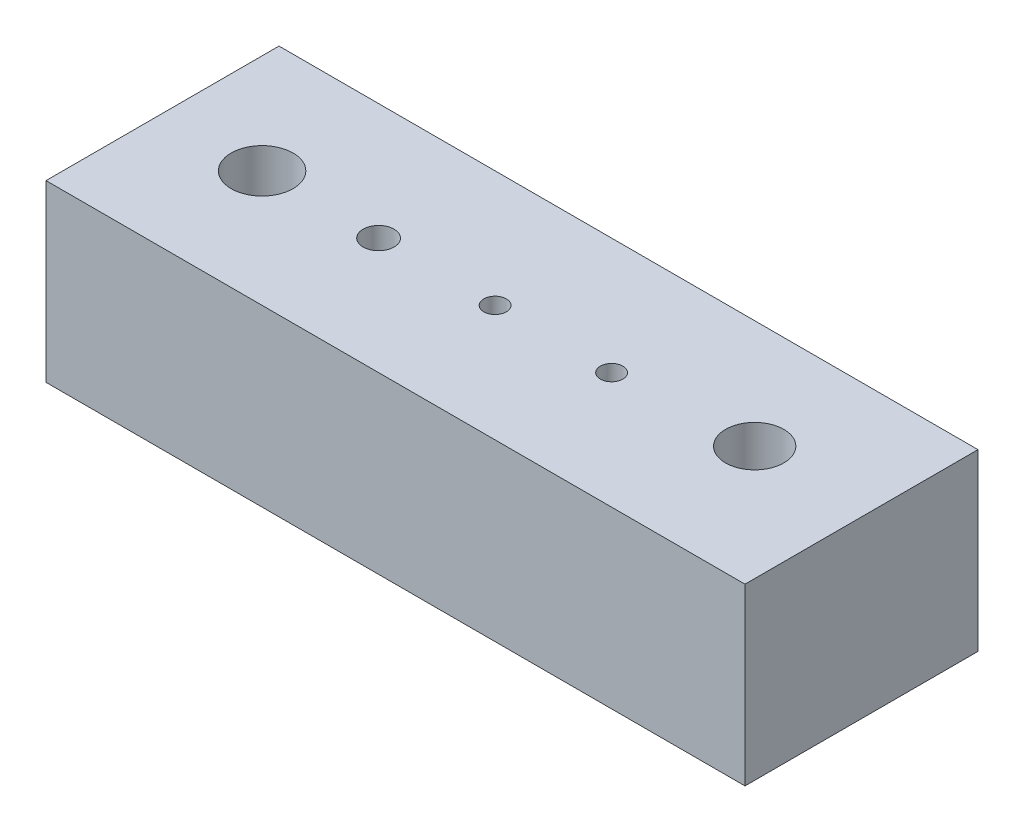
ISO-10303-21;
HEADER;
FILE_DESCRIPTION(('STEP AP214'),'2;1');
FILE_NAME('part.step','',(''),(''),'','','');
FILE_SCHEMA(('AUTOMOTIVE_DESIGN { 1 0 10303 214 1 1 1 1 }'));
ENDSEC;
DATA;
#1=APPLICATION_CONTEXT('core data for automotive mechanical design processes');
#2=APPLICATION_PROTOCOL_DEFINITION('international standard','automotive_design',2000,#1);
#3=PRODUCT_CONTEXT('',#1,'mechanical');
#4=PRODUCT('Part','Part','',(#3));
#5=PRODUCT_RELATED_PRODUCT_CATEGORY('part','',(#4));
#6=PRODUCT_DEFINITION_FORMATION('','',#4);
#7=PRODUCT_DEFINITION_CONTEXT('part definition',#1,'design');
#8=PRODUCT_DEFINITION('design','',#6,#7);
#9=PRODUCT_DEFINITION_SHAPE('','',#8);
#10=(LENGTH_UNIT() NAMED_UNIT(*) SI_UNIT(.MILLI.,.METRE.));
#11=(NAMED_UNIT(*) PLANE_ANGLE_UNIT() SI_UNIT($,.RADIAN.));
#12=(NAMED_UNIT(*) SI_UNIT($,.STERADIAN.) SOLID_ANGLE_UNIT());
#13=UNCERTAINTY_MEASURE_WITH_UNIT(LENGTH_MEASURE(1.E-05),#10,'distance_accuracy_value','');
#14=(GEOMETRIC_REPRESENTATION_CONTEXT(3) GLOBAL_UNCERTAINTY_ASSIGNED_CONTEXT((#13)) GLOBAL_UNIT_ASSIGNED_CONTEXT((#10,
#11,#12)) REPRESENTATION_CONTEXT('',''));
#15=CARTESIAN_POINT('',(0.,0.,0.));
#16=DIRECTION('',(0.,0.,1.));
#17=DIRECTION('',(1.,0.,0.));
#18=AXIS2_PLACEMENT_3D('',#15,#16,#17);
#19=CARTESIAN_POINT('',(0.,38.1,0.));
#20=DIRECTION('',(1.,0.,0.));
#21=DIRECTION('',(0.,0.,-1.));
#22=AXIS2_PLACEMENT_3D('',#19,#20,#21);
#23=PLANE('',#22);
#24=DIRECTION('',(0.,0.,1.));
#25=VECTOR('',#24,1.);
#26=CARTESIAN_POINT('',(0.,0.,0.));
#27=LINE('',#26,#25);
#28=CARTESIAN_POINT('',(0.,0.,-50.8));
#29=VERTEX_POINT('',#28);
#30=CARTESIAN_POINT('',(0.,0.,0.));
#31=VERTEX_POINT('',#30);
#32=EDGE_CURVE('E96',#29,#31,#27,.T.);
#33=ORIENTED_EDGE('',*,*,#32,.T.);
#34=DIRECTION('',(0.,-1.,0.));
#35=VECTOR('',#34,1.);
#36=CARTESIAN_POINT('',(0.,38.1,0.));
#37=LINE('',#36,#35);
#38=CARTESIAN_POINT('',(0.,38.1,0.));
#39=VERTEX_POINT('',#38);
#40=EDGE_CURVE('E11',#39,#31,#37,.T.);
#41=ORIENTED_EDGE('',*,*,#40,.F.);
#42=DIRECTION('',(0.,0.,1.));
#43=VECTOR('',#42,1.);
#44=CARTESIAN_POINT('',(0.,38.1,0.));
#45=LINE('',#44,#43);
#46=CARTESIAN_POINT('',(0.,38.1,-50.8));
#47=VERTEX_POINT('',#46);
#48=EDGE_CURVE('E84',#47,#39,#45,.T.);
#49=ORIENTED_EDGE('',*,*,#48,.F.);
#50=DIRECTION('',(0.,-1.,0.));
#51=VECTOR('',#50,1.);
#52=CARTESIAN_POINT('',(0.,38.1,-50.8));
#53=LINE('',#52,#51);
#54=EDGE_CURVE('E92',#47,#29,#53,.T.);
#55=ORIENTED_EDGE('',*,*,#54,.T.);
#56=EDGE_LOOP('',(#33,#41,#49,#55));
#57=FACE_BOUND('',#56,.T.);
#58=ADVANCED_FACE('F33',(#57),#23,.F.);
#59=CARTESIAN_POINT('',(0.,38.1,0.));
#60=DIRECTION('',(0.,0.,-1.));
#61=DIRECTION('',(-1.,0.,0.));
#62=AXIS2_PLACEMENT_3D('',#59,#60,#61);
#63=PLANE('',#62);
#64=DIRECTION('',(1.,0.,0.));
#65=VECTOR('',#64,1.);
#66=CARTESIAN_POINT('',(0.,0.,0.));
#67=LINE('',#66,#65);
#68=CARTESIAN_POINT('',(152.4,0.,0.));
#69=VERTEX_POINT('',#68);
#70=EDGE_CURVE('E88',#31,#69,#67,.T.);
#71=ORIENTED_EDGE('',*,*,#70,.T.);
#72=DIRECTION('',(0.,-1.,0.));
#73=VECTOR('',#72,1.);
#74=CARTESIAN_POINT('',(152.4,38.1,0.));
#75=LINE('',#74,#73);
#76=CARTESIAN_POINT('',(152.4,38.1,0.));
#77=VERTEX_POINT('',#76);
#78=EDGE_CURVE('E41',#77,#69,#75,.T.);
#79=ORIENTED_EDGE('',*,*,#78,.F.);
#80=DIRECTION('',(1.,0.,0.));
#81=VECTOR('',#80,1.);
#82=CARTESIAN_POINT('',(0.,38.1,0.));
#83=LINE('',#82,#81);
#84=EDGE_CURVE('E79',#39,#77,#83,.T.);
#85=ORIENTED_EDGE('',*,*,#84,.F.);
#86=ORIENTED_EDGE('',*,*,#40,.T.);
#87=EDGE_LOOP('',(#71,#79,#85,#86));
#88=FACE_BOUND('',#87,.T.);
#89=ADVANCED_FACE('F87',(#88),#63,.F.);
#90=CARTESIAN_POINT('',(152.4,38.1,0.));
#91=DIRECTION('',(-1.,0.,0.));
#92=DIRECTION('',(0.,0.,1.));
#93=AXIS2_PLACEMENT_3D('',#90,#91,#92);
#94=PLANE('',#93);
#95=DIRECTION('',(0.,0.,-1.));
#96=VECTOR('',#95,1.);
#97=CARTESIAN_POINT('',(152.4,0.,0.));
#98=LINE('',#97,#96);
#99=CARTESIAN_POINT('',(152.4,0.,-50.8));
#100=VERTEX_POINT('',#99);
#101=EDGE_CURVE('E66',#69,#100,#98,.T.);
#102=ORIENTED_EDGE('',*,*,#101,.T.);
#103=DIRECTION('',(0.,-1.,0.));
#104=VECTOR('',#103,1.);
#105=CARTESIAN_POINT('',(152.4,38.1,-50.8));
#106=LINE('',#105,#104);
#107=CARTESIAN_POINT('',(152.4,38.1,-50.8));
#108=VERTEX_POINT('',#107);
#109=EDGE_CURVE('E89',#108,#100,#106,.T.);
#110=ORIENTED_EDGE('',*,*,#109,.F.);
#111=DIRECTION('',(0.,0.,-1.));
#112=VECTOR('',#111,1.);
#113=CARTESIAN_POINT('',(152.4,38.1,0.));
#114=LINE('',#113,#112);
#115=EDGE_CURVE('E82',#77,#108,#114,.T.);
#116=ORIENTED_EDGE('',*,*,#115,.F.);
#117=ORIENTED_EDGE('',*,*,#78,.T.);
#118=EDGE_LOOP('',(#102,#110,#116,#117));
#119=FACE_BOUND('',#118,.T.);
#120=ADVANCED_FACE('F90',(#119),#94,.F.);
#121=CARTESIAN_POINT('',(0.,38.1,-50.8));
#122=DIRECTION('',(0.,0.,1.));
#123=DIRECTION('',(1.,0.,0.));
#124=AXIS2_PLACEMENT_3D('',#121,#122,#123);
#125=PLANE('',#124);
#126=DIRECTION('',(-1.,0.,0.));
#127=VECTOR('',#126,1.);
#128=CARTESIAN_POINT('',(0.,0.,-50.8));
#129=LINE('',#128,#127);
#130=EDGE_CURVE('E72',#100,#29,#129,.T.);
#131=ORIENTED_EDGE('',*,*,#130,.T.);
#132=ORIENTED_EDGE('',*,*,#54,.F.);
#133=DIRECTION('',(-1.,0.,0.));
#134=VECTOR('',#133,1.);
#135=CARTESIAN_POINT('',(0.,38.1,-50.8));
#136=LINE('',#135,#134);
#137=EDGE_CURVE('E49',#108,#47,#136,.T.);
#138=ORIENTED_EDGE('',*,*,#137,.F.);
#139=ORIENTED_EDGE('',*,*,#109,.T.);
#140=EDGE_LOOP('',(#131,#132,#138,#139));
#141=FACE_BOUND('',#140,.T.);
#142=ADVANCED_FACE('F104',(#141),#125,.F.);
#143=CARTESIAN_POINT('',(0.,38.1,0.));
#144=DIRECTION('',(0.,-1.,0.));
#145=DIRECTION('',(0.,0.,-1.));
#146=AXIS2_PLACEMENT_3D('',#143,#144,#145);
#147=PLANE('',#146);
#148=CARTESIAN_POINT('',(127.399862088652,38.1,-27.1142155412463));
#149=DIRECTION('',(0.,1.,0.));
#150=DIRECTION('',(0.,0.,1.));
#151=AXIS2_PLACEMENT_3D('',#148,#149,#150);
#152=CIRCLE('',#151,6.34999999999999);
#153=CARTESIAN_POINT('',(127.399862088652,38.1,-20.7642155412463));
#154=VERTEX_POINT('',#153);
#155=EDGE_CURVE('E136',#154,#154,#152,.T.);
#156=ORIENTED_EDGE('',*,*,#155,.F.);
#157=EDGE_LOOP('',(#156));
#158=FACE_BOUND('',#157,.T.);
#159=CARTESIAN_POINT('',(97.917,38.1,-25.4));
#160=DIRECTION('',(0.,1.,0.));
#161=DIRECTION('',(0.,0.,1.));
#162=AXIS2_PLACEMENT_3D('',#159,#160,#161);
#163=CIRCLE('',#162,2.45745);
#164=CARTESIAN_POINT('',(97.917,38.1,-22.94255));
#165=VERTEX_POINT('',#164);
#166=EDGE_CURVE('E130',#165,#165,#163,.T.);
#167=ORIENTED_EDGE('',*,*,#166,.F.);
#168=EDGE_LOOP('',(#167));
#169=FACE_BOUND('',#168,.T.);
#170=CARTESIAN_POINT('',(72.517,38.1,-25.4));
#171=DIRECTION('',(0.,1.,0.));
#172=DIRECTION('',(0.,0.,1.));
#173=AXIS2_PLACEMENT_3D('',#170,#171,#172);
#174=CIRCLE('',#173,2.45745);
#175=CARTESIAN_POINT('',(72.517,38.1,-22.94255));
#176=VERTEX_POINT('',#175);
#177=EDGE_CURVE('E124',#176,#176,#174,.T.);
#178=ORIENTED_EDGE('',*,*,#177,.F.);
#179=EDGE_LOOP('',(#178));
#180=FACE_BOUND('',#179,.T.);
#181=CARTESIAN_POINT('',(47.117,38.1,-25.4));
#182=DIRECTION('',(0.,1.,0.));
#183=DIRECTION('',(0.,0.,1.));
#184=AXIS2_PLACEMENT_3D('',#181,#182,#183);
#185=CIRCLE('',#184,3.3782);
#186=CARTESIAN_POINT('',(47.117,38.1,-22.0218));
#187=VERTEX_POINT('',#186);
#188=EDGE_CURVE('E118',#187,#187,#185,.T.);
#189=ORIENTED_EDGE('',*,*,#188,.F.);
#190=EDGE_LOOP('',(#189));
#191=FACE_BOUND('',#190,.T.);
#192=CARTESIAN_POINT('',(21.717,38.1,-25.4));
#193=DIRECTION('',(0.,1.,0.));
#194=DIRECTION('',(0.,0.,1.));
#195=AXIS2_PLACEMENT_3D('',#192,#193,#194);
#196=CIRCLE('',#195,6.74623999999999);
#197=CARTESIAN_POINT('',(21.717,38.1,-18.65376));
#198=VERTEX_POINT('',#197);
#199=EDGE_CURVE('E112',#198,#198,#196,.T.);
#200=ORIENTED_EDGE('',*,*,#199,.F.);
#201=EDGE_LOOP('',(#200));
#202=FACE_BOUND('',#201,.T.);
#203=ORIENTED_EDGE('',*,*,#48,.T.);
#204=ORIENTED_EDGE('',*,*,#84,.T.);
#205=ORIENTED_EDGE('',*,*,#115,.T.);
#206=ORIENTED_EDGE('',*,*,#137,.T.);
#207=EDGE_LOOP('',(#203,#204,#205,#206));
#208=FACE_BOUND('',#207,.T.);
#209=ADVANCED_FACE('F80',(#158,#169,#180,#191,#202,#208),#147,.F.);
#210=CARTESIAN_POINT('',(0.,0.,0.));
#211=DIRECTION('',(0.,-1.,0.));
#212=DIRECTION('',(0.,0.,-1.));
#213=AXIS2_PLACEMENT_3D('',#210,#211,#212);
#214=PLANE('',#213);
#215=CARTESIAN_POINT('',(127.399862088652,0.,-27.1142155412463));
#216=DIRECTION('',(0.,1.,0.));
#217=DIRECTION('',(0.,0.,1.));
#218=AXIS2_PLACEMENT_3D('',#215,#216,#217);
#219=CIRCLE('',#218,6.34999999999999);
#220=CARTESIAN_POINT('',(127.399862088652,0.,-20.7642155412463));
#221=VERTEX_POINT('',#220);
#222=EDGE_CURVE('E133',#221,#221,#219,.T.);
#223=ORIENTED_EDGE('',*,*,#222,.T.);
#224=EDGE_LOOP('',(#223));
#225=FACE_BOUND('',#224,.T.);
#226=CARTESIAN_POINT('',(97.917,0.,-25.4));
#227=DIRECTION('',(0.,1.,0.));
#228=DIRECTION('',(0.,0.,1.));
#229=AXIS2_PLACEMENT_3D('',#226,#227,#228);
#230=CIRCLE('',#229,2.45744999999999);
#231=CARTESIAN_POINT('',(97.917,0.,-22.94255));
#232=VERTEX_POINT('',#231);
#233=EDGE_CURVE('E127',#232,#232,#230,.T.);
#234=ORIENTED_EDGE('',*,*,#233,.T.);
#235=EDGE_LOOP('',(#234));
#236=FACE_BOUND('',#235,.T.);
#237=CARTESIAN_POINT('',(72.517,0.,-25.4));
#238=DIRECTION('',(0.,1.,0.));
#239=DIRECTION('',(0.,0.,1.));
#240=AXIS2_PLACEMENT_3D('',#237,#238,#239);
#241=CIRCLE('',#240,2.45744999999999);
#242=CARTESIAN_POINT('',(72.517,0.,-22.94255));
#243=VERTEX_POINT('',#242);
#244=EDGE_CURVE('E121',#243,#243,#241,.T.);
#245=ORIENTED_EDGE('',*,*,#244,.T.);
#246=EDGE_LOOP('',(#245));
#247=FACE_BOUND('',#246,.T.);
#248=CARTESIAN_POINT('',(47.117,0.,-25.4));
#249=DIRECTION('',(0.,1.,0.));
#250=DIRECTION('',(0.,0.,1.));
#251=AXIS2_PLACEMENT_3D('',#248,#249,#250);
#252=CIRCLE('',#251,3.37819999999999);
#253=CARTESIAN_POINT('',(47.117,0.,-22.0218));
#254=VERTEX_POINT('',#253);
#255=EDGE_CURVE('E115',#254,#254,#252,.T.);
#256=ORIENTED_EDGE('',*,*,#255,.T.);
#257=EDGE_LOOP('',(#256));
#258=FACE_BOUND('',#257,.T.);
#259=CARTESIAN_POINT('',(21.717,0.,-25.4));
#260=DIRECTION('',(0.,-1.,0.));
#261=DIRECTION('',(0.,0.,-1.));
#262=AXIS2_PLACEMENT_3D('',#259,#260,#261);
#263=CIRCLE('',#262,6.74623999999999);
#264=CARTESIAN_POINT('',(21.717,0.,-32.14624));
#265=VERTEX_POINT('',#264);
#266=EDGE_CURVE('E99',#265,#265,#263,.T.);
#267=ORIENTED_EDGE('',*,*,#266,.F.);
#268=EDGE_LOOP('',(#267));
#269=FACE_BOUND('',#268,.T.);
#270=ORIENTED_EDGE('',*,*,#32,.F.);
#271=ORIENTED_EDGE('',*,*,#130,.F.);
#272=ORIENTED_EDGE('',*,*,#101,.F.);
#273=ORIENTED_EDGE('',*,*,#70,.F.);
#274=EDGE_LOOP('',(#270,#271,#272,#273));
#275=FACE_BOUND('',#274,.T.);
#276=ADVANCED_FACE('F107',(#225,#236,#247,#258,#269,#275),#214,.T.);
#277=CARTESIAN_POINT('',(21.717,38.1,-25.4));
#278=DIRECTION('',(0.,1.,0.));
#279=DIRECTION('',(0.,0.,1.));
#280=AXIS2_PLACEMENT_3D('',#277,#278,#279);
#281=CYLINDRICAL_SURFACE('',#280,6.74623999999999);
#282=ORIENTED_EDGE('',*,*,#199,.T.);
#283=EDGE_LOOP('',(#282));
#284=FACE_BOUND('',#283,.T.);
#285=ORIENTED_EDGE('',*,*,#266,.T.);
#286=EDGE_LOOP('',(#285));
#287=FACE_BOUND('',#286,.T.);
#288=ADVANCED_FACE('F153',(#284,#287),#281,.F.);
#289=CARTESIAN_POINT('',(47.117,38.1,-25.4));
#290=DIRECTION('',(0.,1.,0.));
#291=DIRECTION('',(0.,0.,1.));
#292=AXIS2_PLACEMENT_3D('',#289,#290,#291);
#293=CYLINDRICAL_SURFACE('',#292,3.37819999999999);
#294=ORIENTED_EDGE('',*,*,#255,.F.);
#295=EDGE_LOOP('',(#294));
#296=FACE_BOUND('',#295,.T.);
#297=ORIENTED_EDGE('',*,*,#188,.T.);
#298=EDGE_LOOP('',(#297));
#299=FACE_BOUND('',#298,.T.);
#300=ADVANCED_FACE('F156',(#296,#299),#293,.F.);
#301=CARTESIAN_POINT('',(72.517,38.1,-25.4));
#302=DIRECTION('',(0.,1.,0.));
#303=DIRECTION('',(0.,0.,1.));
#304=AXIS2_PLACEMENT_3D('',#301,#302,#303);
#305=CYLINDRICAL_SURFACE('',#304,2.45744999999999);
#306=ORIENTED_EDGE('',*,*,#244,.F.);
#307=EDGE_LOOP('',(#306));
#308=FACE_BOUND('',#307,.T.);
#309=ORIENTED_EDGE('',*,*,#177,.T.);
#310=EDGE_LOOP('',(#309));
#311=FACE_BOUND('',#310,.T.);
#312=ADVANCED_FACE('F211',(#308,#311),#305,.F.);
#313=CARTESIAN_POINT('',(97.917,38.1,-25.4));
#314=DIRECTION('',(0.,1.,0.));
#315=DIRECTION('',(0.,0.,1.));
#316=AXIS2_PLACEMENT_3D('',#313,#314,#315);
#317=CYLINDRICAL_SURFACE('',#316,2.45744999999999);
#318=ORIENTED_EDGE('',*,*,#233,.F.);
#319=EDGE_LOOP('',(#318));
#320=FACE_BOUND('',#319,.T.);
#321=ORIENTED_EDGE('',*,*,#166,.T.);
#322=EDGE_LOOP('',(#321));
#323=FACE_BOUND('',#322,.T.);
#324=ADVANCED_FACE('F191',(#320,#323),#317,.F.);
#325=CARTESIAN_POINT('',(127.399862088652,38.1,-27.1142155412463));
#326=DIRECTION('',(0.,1.,0.));
#327=DIRECTION('',(0.,0.,1.));
#328=AXIS2_PLACEMENT_3D('',#325,#326,#327);
#329=CYLINDRICAL_SURFACE('',#328,6.34999999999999);
#330=ORIENTED_EDGE('',*,*,#222,.F.);
#331=EDGE_LOOP('',(#330));
#332=FACE_BOUND('',#331,.T.);
#333=ORIENTED_EDGE('',*,*,#155,.T.);
#334=EDGE_LOOP('',(#333));
#335=FACE_BOUND('',#334,.T.);
#336=ADVANCED_FACE('F140',(#332,#335),#329,.F.);
#337=CLOSED_SHELL('',(#58,#89,#120,#142,#209,#276,#288,#300,#312,#324,#336));
#338=MANIFOLD_SOLID_BREP('B2',#337);
#339=ADVANCED_BREP_SHAPE_REPRESENTATION('',(#18,#338),#14);
#340=SHAPE_DEFINITION_REPRESENTATION(#9,#339);
ENDSEC;
END-ISO-10303-21;
